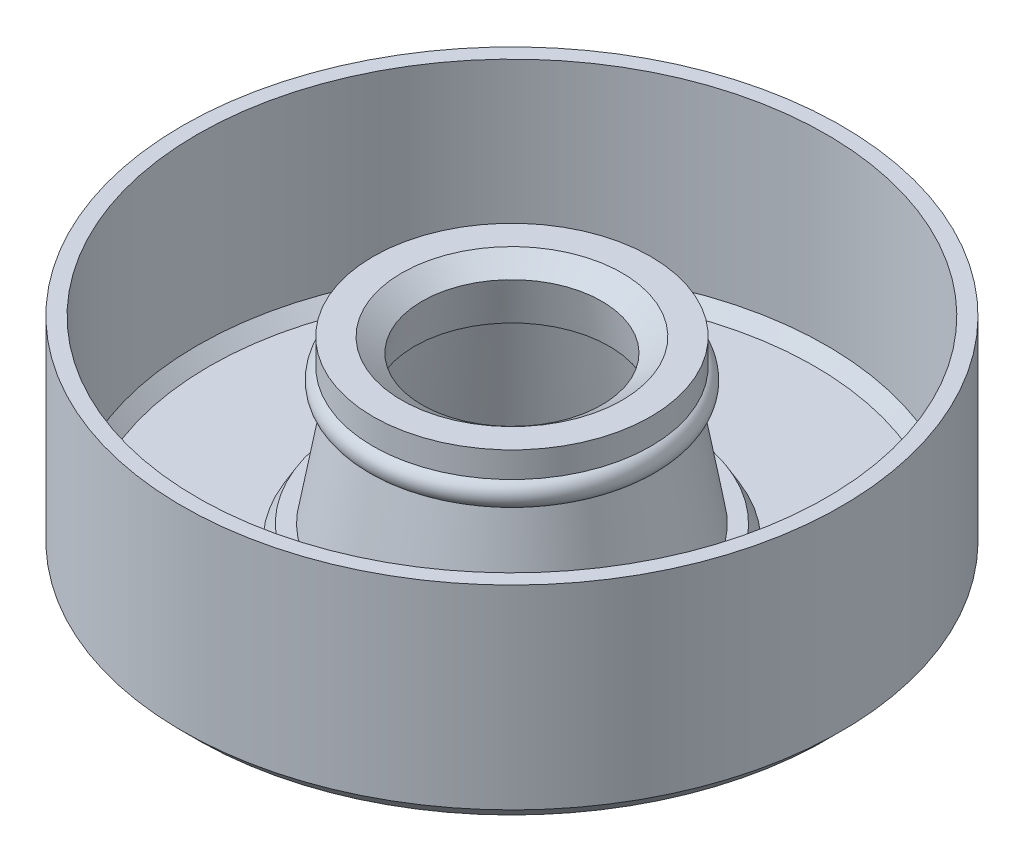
ISO-10303-21;
HEADER;
FILE_DESCRIPTION(('STEP AP214'),'2;1');
FILE_NAME('part.step','',(''),(''),'','','');
FILE_SCHEMA(('AUTOMOTIVE_DESIGN { 1 0 10303 214 1 1 1 1 }'));
ENDSEC;
DATA;
#1=APPLICATION_CONTEXT('core data for automotive mechanical design processes');
#2=APPLICATION_PROTOCOL_DEFINITION('international standard','automotive_design',2000,#1);
#3=PRODUCT_CONTEXT('',#1,'mechanical');
#4=PRODUCT('Part','Part','',(#3));
#5=PRODUCT_RELATED_PRODUCT_CATEGORY('part','',(#4));
#6=PRODUCT_DEFINITION_FORMATION('','',#4);
#7=PRODUCT_DEFINITION_CONTEXT('part definition',#1,'design');
#8=PRODUCT_DEFINITION('design','',#6,#7);
#9=PRODUCT_DEFINITION_SHAPE('','',#8);
#10=(LENGTH_UNIT() NAMED_UNIT(*) SI_UNIT(.MILLI.,.METRE.));
#11=(NAMED_UNIT(*) PLANE_ANGLE_UNIT() SI_UNIT($,.RADIAN.));
#12=(NAMED_UNIT(*) SI_UNIT($,.STERADIAN.) SOLID_ANGLE_UNIT());
#13=UNCERTAINTY_MEASURE_WITH_UNIT(LENGTH_MEASURE(1.E-05),#10,'distance_accuracy_value','');
#14=(GEOMETRIC_REPRESENTATION_CONTEXT(3) GLOBAL_UNCERTAINTY_ASSIGNED_CONTEXT((#13)) GLOBAL_UNIT_ASSIGNED_CONTEXT((#10,
#11,#12)) REPRESENTATION_CONTEXT('',''));
#15=CARTESIAN_POINT('',(0.,0.,0.));
#16=DIRECTION('',(0.,0.,1.));
#17=DIRECTION('',(1.,0.,0.));
#18=AXIS2_PLACEMENT_3D('',#15,#16,#17);
#19=CARTESIAN_POINT('',(0.,4.70040545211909,0.));
#20=DIRECTION('',(0.,-1.,0.));
#21=DIRECTION('',(1.,0.,0.));
#22=AXIS2_PLACEMENT_3D('',#19,#20,#21);
#23=CONICAL_SURFACE('',#22,4.43245143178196,0.174532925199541);
#24=CARTESIAN_POINT('',(0.,1.00000000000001,0.));
#25=DIRECTION('',(0.,1.,0.));
#26=DIRECTION('',(-1.,0.,0.));
#27=AXIS2_PLACEMENT_3D('',#24,#25,#26);
#28=CIRCLE('',#27,5.08493275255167);
#29=CARTESIAN_POINT('',(-5.08493275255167,1.00000000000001,0.));
#30=VERTEX_POINT('',#29);
#31=EDGE_CURVE('E10',#30,#30,#28,.T.);
#32=ORIENTED_EDGE('',*,*,#31,.T.);
#33=EDGE_LOOP('',(#32));
#34=FACE_BOUND('',#33,.T.);
#35=CARTESIAN_POINT('',(0.,4.70040545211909,0.));
#36=DIRECTION('',(0.,1.,0.));
#37=DIRECTION('',(-1.,0.,0.));
#38=AXIS2_PLACEMENT_3D('',#35,#36,#37);
#39=CIRCLE('',#38,4.43245143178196);
#40=CARTESIAN_POINT('',(-4.43245143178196,4.70040545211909,0.));
#41=VERTEX_POINT('',#40);
#42=EDGE_CURVE('E84',#41,#41,#39,.T.);
#43=ORIENTED_EDGE('',*,*,#42,.F.);
#44=EDGE_LOOP('',(#43));
#45=FACE_BOUND('',#44,.T.);
#46=ADVANCED_FACE('F29',(#34,#45),#23,.T.);
#47=CARTESIAN_POINT('',(-5.08493275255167,1.00000000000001,0.));
#48=DIRECTION('',(0.,1.,0.));
#49=DIRECTION('',(-1.,0.,0.));
#50=AXIS2_PLACEMENT_3D('',#47,#48,#49);
#51=PLANE('',#50);
#52=CARTESIAN_POINT('',(0.,1.00000000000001,0.));
#53=DIRECTION('',(0.,1.,0.));
#54=DIRECTION('',(-1.,0.,0.));
#55=AXIS2_PLACEMENT_3D('',#52,#53,#54);
#56=CIRCLE('',#55,5.58493275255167);
#57=CARTESIAN_POINT('',(-5.58493275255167,1.00000000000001,0.));
#58=VERTEX_POINT('',#57);
#59=EDGE_CURVE('E35',#58,#58,#56,.T.);
#60=ORIENTED_EDGE('',*,*,#59,.T.);
#61=EDGE_LOOP('',(#60));
#62=FACE_BOUND('',#61,.T.);
#63=ORIENTED_EDGE('',*,*,#31,.F.);
#64=EDGE_LOOP('',(#63));
#65=FACE_BOUND('',#64,.T.);
#66=ADVANCED_FACE('F92',(#62,#65),#51,.T.);
#67=CARTESIAN_POINT('',(0.,1.00000000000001,0.));
#68=DIRECTION('',(0.,-1.,0.));
#69=DIRECTION('',(1.,0.,0.));
#70=AXIS2_PLACEMENT_3D('',#67,#68,#69);
#71=CONICAL_SURFACE('',#70,5.58493275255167,0.523598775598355);
#72=CARTESIAN_POINT('',(0.,0.500000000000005,0.));
#73=DIRECTION('',(0.,1.,0.));
#74=DIRECTION('',(-1.,0.,0.));
#75=AXIS2_PLACEMENT_3D('',#72,#73,#74);
#76=CIRCLE('',#75,5.87360788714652);
#77=CARTESIAN_POINT('',(-5.87360788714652,0.500000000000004,0.));
#78=VERTEX_POINT('',#77);
#79=EDGE_CURVE('E39',#78,#78,#76,.T.);
#80=ORIENTED_EDGE('',*,*,#79,.T.);
#81=EDGE_LOOP('',(#80));
#82=FACE_BOUND('',#81,.T.);
#83=ORIENTED_EDGE('',*,*,#59,.F.);
#84=EDGE_LOOP('',(#83));
#85=FACE_BOUND('',#84,.T.);
#86=ADVANCED_FACE('F96',(#82,#85),#71,.T.);
#87=CARTESIAN_POINT('',(-10.1,0.500000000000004,0.));
#88=DIRECTION('',(0.,1.,0.));
#89=DIRECTION('',(-1.,0.,0.));
#90=AXIS2_PLACEMENT_3D('',#87,#88,#89);
#91=PLANE('',#90);
#92=CARTESIAN_POINT('',(0.,0.500000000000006,0.));
#93=DIRECTION('',(0.,1.,0.));
#94=DIRECTION('',(-1.,0.,0.));
#95=AXIS2_PLACEMENT_3D('',#92,#93,#94);
#96=CIRCLE('',#95,10.1);
#97=CARTESIAN_POINT('',(-10.1,0.500000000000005,0.));
#98=VERTEX_POINT('',#97);
#99=EDGE_CURVE('E43',#98,#98,#96,.T.);
#100=ORIENTED_EDGE('',*,*,#99,.T.);
#101=EDGE_LOOP('',(#100));
#102=FACE_BOUND('',#101,.T.);
#103=ORIENTED_EDGE('',*,*,#79,.F.);
#104=EDGE_LOOP('',(#103));
#105=FACE_BOUND('',#104,.T.);
#106=ADVANCED_FACE('F100',(#102,#105),#91,.T.);
#107=CARTESIAN_POINT('',(0.,0.500000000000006,0.));
#108=DIRECTION('',(0.,1.,0.));
#109=DIRECTION('',(-1.,0.,0.));
#110=AXIS2_PLACEMENT_3D('',#107,#108,#109);
#111=CONICAL_SURFACE('',#110,10.1,0.785398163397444);
#112=CARTESIAN_POINT('',(0.,0.90000000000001,0.));
#113=DIRECTION('',(0.,1.,0.));
#114=DIRECTION('',(-1.,0.,0.));
#115=AXIS2_PLACEMENT_3D('',#112,#113,#114);
#116=CIRCLE('',#115,10.5);
#117=CARTESIAN_POINT('',(-10.5,0.900000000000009,0.));
#118=VERTEX_POINT('',#117);
#119=EDGE_CURVE('E48',#118,#118,#116,.T.);
#120=ORIENTED_EDGE('',*,*,#119,.T.);
#121=EDGE_LOOP('',(#120));
#122=FACE_BOUND('',#121,.T.);
#123=ORIENTED_EDGE('',*,*,#99,.F.);
#124=EDGE_LOOP('',(#123));
#125=FACE_BOUND('',#124,.T.);
#126=ADVANCED_FACE('F107',(#122,#125),#111,.F.);
#127=CARTESIAN_POINT('',(0.,5.83619336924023,0.));
#128=DIRECTION('',(0.,1.,0.));
#129=DIRECTION('',(-1.,0.,0.));
#130=AXIS2_PLACEMENT_3D('',#127,#128,#129);
#131=CYLINDRICAL_SURFACE('',#130,10.5);
#132=CARTESIAN_POINT('',(0.,7.00000000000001,0.));
#133=DIRECTION('',(0.,1.,0.));
#134=DIRECTION('',(-1.,0.,0.));
#135=AXIS2_PLACEMENT_3D('',#132,#133,#134);
#136=CIRCLE('',#135,10.5);
#137=CARTESIAN_POINT('',(-10.5,7.00000000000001,0.));
#138=VERTEX_POINT('',#137);
#139=EDGE_CURVE('E51',#138,#138,#136,.T.);
#140=ORIENTED_EDGE('',*,*,#139,.T.);
#141=EDGE_LOOP('',(#140));
#142=FACE_BOUND('',#141,.T.);
#143=ORIENTED_EDGE('',*,*,#119,.F.);
#144=EDGE_LOOP('',(#143));
#145=FACE_BOUND('',#144,.T.);
#146=ADVANCED_FACE('F111',(#142,#145),#131,.F.);
#147=CARTESIAN_POINT('',(-10.5,7.00000000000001,0.));
#148=DIRECTION('',(0.,1.,0.));
#149=DIRECTION('',(-1.,0.,0.));
#150=AXIS2_PLACEMENT_3D('',#147,#148,#149);
#151=PLANE('',#150);
#152=CARTESIAN_POINT('',(0.,7.00000000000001,0.));
#153=DIRECTION('',(0.,1.,0.));
#154=DIRECTION('',(-1.,0.,0.));
#155=AXIS2_PLACEMENT_3D('',#152,#153,#154);
#156=CIRCLE('',#155,11.);
#157=CARTESIAN_POINT('',(-11.,7.00000000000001,0.));
#158=VERTEX_POINT('',#157);
#159=EDGE_CURVE('E54',#158,#158,#156,.T.);
#160=ORIENTED_EDGE('',*,*,#159,.T.);
#161=EDGE_LOOP('',(#160));
#162=FACE_BOUND('',#161,.T.);
#163=ORIENTED_EDGE('',*,*,#139,.F.);
#164=EDGE_LOOP('',(#163));
#165=FACE_BOUND('',#164,.T.);
#166=ADVANCED_FACE('F115',(#162,#165),#151,.T.);
#167=CARTESIAN_POINT('',(0.,5.83619336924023,0.));
#168=DIRECTION('',(0.,1.,0.));
#169=DIRECTION('',(-1.,0.,0.));
#170=AXIS2_PLACEMENT_3D('',#167,#168,#169);
#171=CYLINDRICAL_SURFACE('',#170,11.);
#172=CARTESIAN_POINT('',(0.,0.500000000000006,0.));
#173=DIRECTION('',(0.,1.,0.));
#174=DIRECTION('',(-1.,0.,0.));
#175=AXIS2_PLACEMENT_3D('',#172,#173,#174);
#176=CIRCLE('',#175,11.);
#177=CARTESIAN_POINT('',(-11.,0.500000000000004,0.));
#178=VERTEX_POINT('',#177);
#179=EDGE_CURVE('E57',#178,#178,#176,.T.);
#180=ORIENTED_EDGE('',*,*,#179,.T.);
#181=EDGE_LOOP('',(#180));
#182=FACE_BOUND('',#181,.T.);
#183=ORIENTED_EDGE('',*,*,#159,.F.);
#184=EDGE_LOOP('',(#183));
#185=FACE_BOUND('',#184,.T.);
#186=ADVANCED_FACE('F119',(#182,#185),#171,.T.);
#187=CARTESIAN_POINT('',(0.,0.500000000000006,0.));
#188=DIRECTION('',(0.,1.,0.));
#189=DIRECTION('',(-1.,0.,0.));
#190=AXIS2_PLACEMENT_3D('',#187,#188,#189);
#191=CONICAL_SURFACE('',#190,11.,0.785398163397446);
#192=CARTESIAN_POINT('',(0.,0.,0.));
#193=DIRECTION('',(0.,1.,0.));
#194=DIRECTION('',(-1.,0.,0.));
#195=AXIS2_PLACEMENT_3D('',#192,#193,#194);
#196=CIRCLE('',#195,10.5);
#197=CARTESIAN_POINT('',(-10.5,0.,0.));
#198=VERTEX_POINT('',#197);
#199=EDGE_CURVE('E60',#198,#198,#196,.T.);
#200=ORIENTED_EDGE('',*,*,#199,.T.);
#201=EDGE_LOOP('',(#200));
#202=FACE_BOUND('',#201,.T.);
#203=ORIENTED_EDGE('',*,*,#179,.F.);
#204=EDGE_LOOP('',(#203));
#205=FACE_BOUND('',#204,.T.);
#206=ADVANCED_FACE('F123',(#202,#205),#191,.T.);
#207=CARTESIAN_POINT('',(-10.5,0.,0.));
#208=DIRECTION('',(0.,-1.,0.));
#209=DIRECTION('',(1.,0.,0.));
#210=AXIS2_PLACEMENT_3D('',#207,#208,#209);
#211=PLANE('',#210);
#212=CARTESIAN_POINT('',(0.,0.,0.));
#213=DIRECTION('',(0.,1.,0.));
#214=DIRECTION('',(-1.,0.,0.));
#215=AXIS2_PLACEMENT_3D('',#212,#213,#214);
#216=CIRCLE('',#215,4.75354642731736);
#217=CARTESIAN_POINT('',(-4.75354642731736,0.,0.));
#218=VERTEX_POINT('',#217);
#219=EDGE_CURVE('E63',#218,#218,#216,.T.);
#220=ORIENTED_EDGE('',*,*,#219,.T.);
#221=EDGE_LOOP('',(#220));
#222=FACE_BOUND('',#221,.T.);
#223=ORIENTED_EDGE('',*,*,#199,.F.);
#224=EDGE_LOOP('',(#223));
#225=FACE_BOUND('',#224,.T.);
#226=ADVANCED_FACE('F127',(#222,#225),#211,.T.);
#227=CARTESIAN_POINT('',(0.,0.,0.));
#228=DIRECTION('',(0.,-1.,0.));
#229=DIRECTION('',(1.,0.,0.));
#230=AXIS2_PLACEMENT_3D('',#227,#228,#229);
#231=CONICAL_SURFACE('',#230,4.75354642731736,0.174532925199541);
#232=CARTESIAN_POINT('',(0.,4.5,0.));
#233=DIRECTION('',(0.,1.,0.));
#234=DIRECTION('',(-1.,0.,0.));
#235=AXIS2_PLACEMENT_3D('',#232,#233,#234);
#236=CIRCLE('',#235,3.96007501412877);
#237=CARTESIAN_POINT('',(-3.96007501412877,4.5,0.));
#238=VERTEX_POINT('',#237);
#239=EDGE_CURVE('E66',#238,#238,#236,.T.);
#240=ORIENTED_EDGE('',*,*,#239,.T.);
#241=EDGE_LOOP('',(#240));
#242=FACE_BOUND('',#241,.T.);
#243=ORIENTED_EDGE('',*,*,#219,.F.);
#244=EDGE_LOOP('',(#243));
#245=FACE_BOUND('',#244,.T.);
#246=ADVANCED_FACE('F131',(#242,#245),#231,.F.);
#247=CARTESIAN_POINT('',(-3.25189568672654,4.5,0.));
#248=DIRECTION('',(0.,-1.,0.));
#249=DIRECTION('',(1.,0.,0.));
#250=AXIS2_PLACEMENT_3D('',#247,#248,#249);
#251=PLANE('',#250);
#252=CARTESIAN_POINT('',(0.,4.5,0.));
#253=DIRECTION('',(0.,1.,0.));
#254=DIRECTION('',(-1.,0.,0.));
#255=AXIS2_PLACEMENT_3D('',#252,#253,#254);
#256=CIRCLE('',#255,3.25189568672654);
#257=CARTESIAN_POINT('',(-3.25189568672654,4.5,0.));
#258=VERTEX_POINT('',#257);
#259=EDGE_CURVE('E69',#258,#258,#256,.T.);
#260=ORIENTED_EDGE('',*,*,#259,.T.);
#261=EDGE_LOOP('',(#260));
#262=FACE_BOUND('',#261,.T.);
#263=ORIENTED_EDGE('',*,*,#239,.F.);
#264=EDGE_LOOP('',(#263));
#265=FACE_BOUND('',#264,.T.);
#266=ADVANCED_FACE('F135',(#262,#265),#251,.T.);
#267=CARTESIAN_POINT('',(0.,4.5,0.));
#268=DIRECTION('',(0.,-1.,0.));
#269=DIRECTION('',(1.,0.,0.));
#270=AXIS2_PLACEMENT_3D('',#267,#268,#269);
#271=CONICAL_SURFACE('',#270,3.25189568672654,0.174532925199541);
#272=CARTESIAN_POINT('',(0.,5.92857142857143,0.));
#273=DIRECTION('',(0.,1.,0.));
#274=DIRECTION('',(-1.,0.,0.));
#275=AXIS2_PLACEMENT_3D('',#272,#273,#274);
#276=CIRCLE('',#275,3.);
#277=CARTESIAN_POINT('',(-3.,5.92857142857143,0.));
#278=VERTEX_POINT('',#277);
#279=EDGE_CURVE('E72',#278,#278,#276,.T.);
#280=ORIENTED_EDGE('',*,*,#279,.T.);
#281=EDGE_LOOP('',(#280));
#282=FACE_BOUND('',#281,.T.);
#283=ORIENTED_EDGE('',*,*,#259,.F.);
#284=EDGE_LOOP('',(#283));
#285=FACE_BOUND('',#284,.T.);
#286=ADVANCED_FACE('F139',(#282,#285),#271,.F.);
#287=CARTESIAN_POINT('',(0.,5.92857142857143,0.));
#288=DIRECTION('',(0.,1.,0.));
#289=DIRECTION('',(-1.,0.,0.));
#290=AXIS2_PLACEMENT_3D('',#287,#288,#289);
#291=CONICAL_SURFACE('',#290,3.,0.959931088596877);
#292=CARTESIAN_POINT('',(0.,6.40476190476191,0.));
#293=DIRECTION('',(0.,1.,0.));
#294=DIRECTION('',(-1.,0.,0.));
#295=AXIS2_PLACEMENT_3D('',#292,#293,#294);
#296=CIRCLE('',#295,3.68007047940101);
#297=CARTESIAN_POINT('',(-3.68007047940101,6.40476190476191,0.));
#298=VERTEX_POINT('',#297);
#299=EDGE_CURVE('E75',#298,#298,#296,.T.);
#300=ORIENTED_EDGE('',*,*,#299,.T.);
#301=EDGE_LOOP('',(#300));
#302=FACE_BOUND('',#301,.T.);
#303=ORIENTED_EDGE('',*,*,#279,.F.);
#304=EDGE_LOOP('',(#303));
#305=FACE_BOUND('',#304,.T.);
#306=ADVANCED_FACE('F143',(#302,#305),#291,.F.);
#307=CARTESIAN_POINT('',(-3.68007047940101,6.40476190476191,0.));
#308=DIRECTION('',(0.,1.,0.));
#309=DIRECTION('',(-1.,0.,0.));
#310=AXIS2_PLACEMENT_3D('',#307,#308,#309);
#311=PLANE('',#310);
#312=CARTESIAN_POINT('',(0.,6.40476190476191,0.));
#313=DIRECTION('',(0.,1.,0.));
#314=DIRECTION('',(-1.,0.,0.));
#315=AXIS2_PLACEMENT_3D('',#312,#313,#314);
#316=CIRCLE('',#315,4.63245143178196);
#317=CARTESIAN_POINT('',(-4.63245143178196,6.40476190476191,0.));
#318=VERTEX_POINT('',#317);
#319=EDGE_CURVE('E78',#318,#318,#316,.T.);
#320=ORIENTED_EDGE('',*,*,#319,.T.);
#321=EDGE_LOOP('',(#320));
#322=FACE_BOUND('',#321,.T.);
#323=ORIENTED_EDGE('',*,*,#299,.F.);
#324=EDGE_LOOP('',(#323));
#325=FACE_BOUND('',#324,.T.);
#326=ADVANCED_FACE('F147',(#322,#325),#311,.T.);
#327=CARTESIAN_POINT('',(0.,5.83619336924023,0.));
#328=DIRECTION('',(0.,1.,0.));
#329=DIRECTION('',(-1.,0.,0.));
#330=AXIS2_PLACEMENT_3D('',#327,#328,#329);
#331=CYLINDRICAL_SURFACE('',#330,4.63245143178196);
#332=CARTESIAN_POINT('',(0.,5.54761904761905,0.));
#333=DIRECTION('',(0.,1.,0.));
#334=DIRECTION('',(-1.,0.,0.));
#335=AXIS2_PLACEMENT_3D('',#332,#333,#334);
#336=CIRCLE('',#335,4.63245143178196);
#337=CARTESIAN_POINT('',(-4.63245143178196,5.54761904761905,0.));
#338=VERTEX_POINT('',#337);
#339=EDGE_CURVE('E81',#338,#338,#336,.T.);
#340=ORIENTED_EDGE('',*,*,#339,.T.);
#341=EDGE_LOOP('',(#340));
#342=FACE_BOUND('',#341,.T.);
#343=ORIENTED_EDGE('',*,*,#319,.F.);
#344=EDGE_LOOP('',(#343));
#345=FACE_BOUND('',#344,.T.);
#346=ADVANCED_FACE('F151',(#342,#345),#331,.T.);
#347=CARTESIAN_POINT('',(0.,5.14761904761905,0.));
#348=DIRECTION('',(0.,1.,0.));
#349=DIRECTION('',(-1.,0.,0.));
#350=AXIS2_PLACEMENT_3D('',#347,#348,#349);
#351=TOROIDAL_SURFACE('',#350,4.43245143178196,0.447213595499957);
#352=ORIENTED_EDGE('',*,*,#42,.T.);
#353=EDGE_LOOP('',(#352));
#354=FACE_BOUND('',#353,.T.);
#355=ORIENTED_EDGE('',*,*,#339,.F.);
#356=EDGE_LOOP('',(#355));
#357=FACE_BOUND('',#356,.T.);
#358=ADVANCED_FACE('F88',(#354,#357),#351,.T.);
#359=CLOSED_SHELL('',(#46,#66,#86,#106,#126,#146,#166,#186,#206,#226,#246,#266,#286,#306,#326,
#346,#358));
#360=MANIFOLD_SOLID_BREP('B2',#359);
#361=ADVANCED_BREP_SHAPE_REPRESENTATION('',(#18,#360),#14);
#362=SHAPE_DEFINITION_REPRESENTATION(#9,#361);
ENDSEC;
END-ISO-10303-21;
